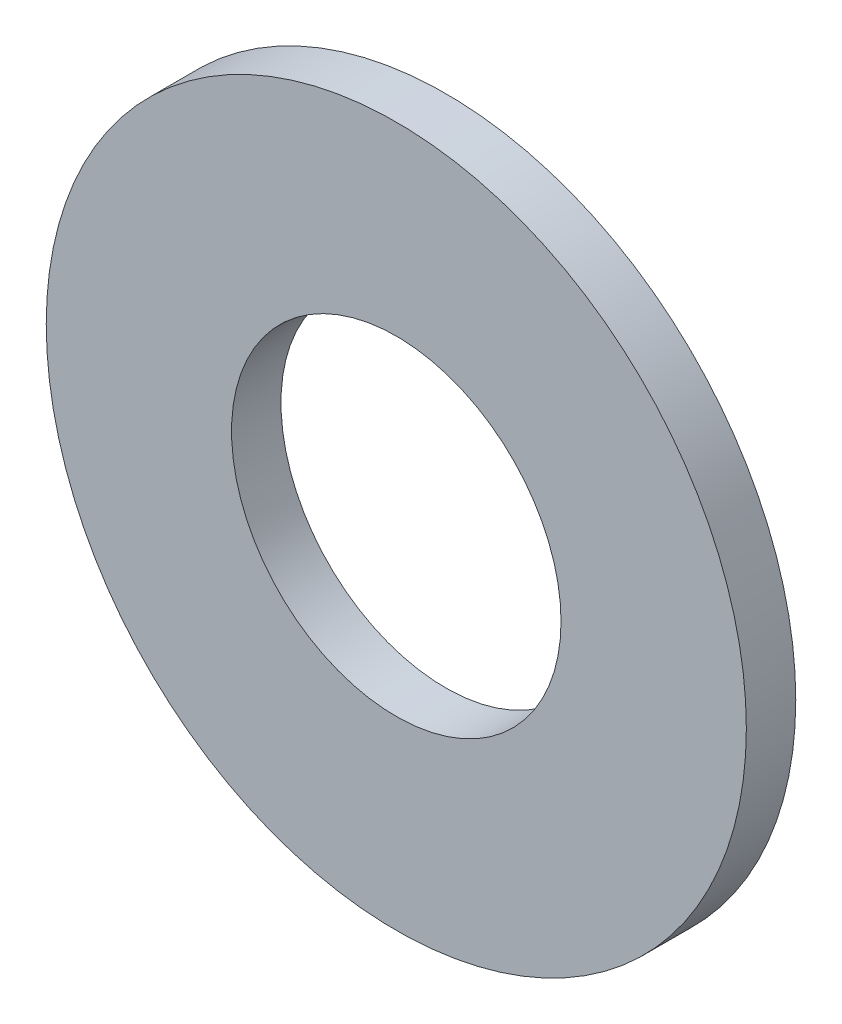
ISO-10303-21;
HEADER;
FILE_DESCRIPTION(('STEP AP214'),'2;1');
FILE_NAME('part.step','',(''),(''),'','','');
FILE_SCHEMA(('AUTOMOTIVE_DESIGN { 1 0 10303 214 1 1 1 1 }'));
ENDSEC;
DATA;
#1=APPLICATION_CONTEXT('core data for automotive mechanical design processes');
#2=APPLICATION_PROTOCOL_DEFINITION('international standard','automotive_design',2000,#1);
#3=PRODUCT_CONTEXT('',#1,'mechanical');
#4=PRODUCT('Part','Part','',(#3));
#5=PRODUCT_RELATED_PRODUCT_CATEGORY('part','',(#4));
#6=PRODUCT_DEFINITION_FORMATION('','',#4);
#7=PRODUCT_DEFINITION_CONTEXT('part definition',#1,'design');
#8=PRODUCT_DEFINITION('design','',#6,#7);
#9=PRODUCT_DEFINITION_SHAPE('','',#8);
#10=(LENGTH_UNIT() NAMED_UNIT(*) SI_UNIT(.MILLI.,.METRE.));
#11=(NAMED_UNIT(*) PLANE_ANGLE_UNIT() SI_UNIT($,.RADIAN.));
#12=(NAMED_UNIT(*) SI_UNIT($,.STERADIAN.) SOLID_ANGLE_UNIT());
#13=UNCERTAINTY_MEASURE_WITH_UNIT(LENGTH_MEASURE(1.E-05),#10,'distance_accuracy_value','');
#14=(GEOMETRIC_REPRESENTATION_CONTEXT(3) GLOBAL_UNCERTAINTY_ASSIGNED_CONTEXT((#13)) GLOBAL_UNIT_ASSIGNED_CONTEXT((#10,
#11,#12)) REPRESENTATION_CONTEXT('',''));
#15=CARTESIAN_POINT('',(0.,0.,0.));
#16=DIRECTION('',(0.,0.,1.));
#17=DIRECTION('',(1.,0.,0.));
#18=AXIS2_PLACEMENT_3D('',#15,#16,#17);
#19=CARTESIAN_POINT('',(0.,0.,1.2));
#20=DIRECTION('',(0.,0.,1.));
#21=DIRECTION('',(1.,0.,0.));
#22=AXIS2_PLACEMENT_3D('',#19,#20,#21);
#23=PLANE('',#22);
#24=CARTESIAN_POINT('',(0.,0.,1.2));
#25=DIRECTION('',(0.,0.,1.));
#26=DIRECTION('',(1.,0.,0.));
#27=AXIS2_PLACEMENT_3D('',#24,#25,#26);
#28=CIRCLE('',#27,8.5);
#29=CARTESIAN_POINT('',(8.5,0.,1.2));
#30=VERTEX_POINT('',#29);
#31=EDGE_CURVE('E10',#30,#30,#28,.T.);
#32=ORIENTED_EDGE('',*,*,#31,.T.);
#33=EDGE_LOOP('',(#32));
#34=FACE_BOUND('',#33,.T.);
#35=CARTESIAN_POINT('',(0.,0.,1.2));
#36=DIRECTION('',(0.,0.,1.));
#37=DIRECTION('',(1.,0.,0.));
#38=AXIS2_PLACEMENT_3D('',#35,#36,#37);
#39=CIRCLE('',#38,4.);
#40=CARTESIAN_POINT('',(4.,0.,1.2));
#41=VERTEX_POINT('',#40);
#42=EDGE_CURVE('E42',#41,#41,#39,.T.);
#43=ORIENTED_EDGE('',*,*,#42,.F.);
#44=EDGE_LOOP('',(#43));
#45=FACE_BOUND('',#44,.T.);
#46=ADVANCED_FACE('F31',(#34,#45),#23,.T.);
#47=CARTESIAN_POINT('',(0.,0.,0.));
#48=DIRECTION('',(0.,0.,1.));
#49=DIRECTION('',(1.,0.,0.));
#50=AXIS2_PLACEMENT_3D('',#47,#48,#49);
#51=PLANE('',#50);
#52=CARTESIAN_POINT('',(0.,0.,0.));
#53=DIRECTION('',(0.,0.,1.));
#54=DIRECTION('',(1.,0.,0.));
#55=AXIS2_PLACEMENT_3D('',#52,#53,#54);
#56=CIRCLE('',#55,8.5);
#57=CARTESIAN_POINT('',(8.5,0.,0.));
#58=VERTEX_POINT('',#57);
#59=EDGE_CURVE('E35',#58,#58,#56,.T.);
#60=ORIENTED_EDGE('',*,*,#59,.F.);
#61=EDGE_LOOP('',(#60));
#62=FACE_BOUND('',#61,.T.);
#63=CARTESIAN_POINT('',(0.,0.,0.));
#64=DIRECTION('',(0.,0.,1.));
#65=DIRECTION('',(1.,0.,0.));
#66=AXIS2_PLACEMENT_3D('',#63,#64,#65);
#67=CIRCLE('',#66,4.);
#68=CARTESIAN_POINT('',(4.,0.,0.));
#69=VERTEX_POINT('',#68);
#70=EDGE_CURVE('E44',#69,#69,#67,.T.);
#71=ORIENTED_EDGE('',*,*,#70,.T.);
#72=EDGE_LOOP('',(#71));
#73=FACE_BOUND('',#72,.T.);
#74=ADVANCED_FACE('F54',(#62,#73),#51,.F.);
#75=CARTESIAN_POINT('',(0.,0.,1.2));
#76=DIRECTION('',(0.,0.,-1.));
#77=DIRECTION('',(-1.,0.,0.));
#78=AXIS2_PLACEMENT_3D('',#75,#76,#77);
#79=CYLINDRICAL_SURFACE('',#78,8.5);
#80=ORIENTED_EDGE('',*,*,#31,.F.);
#81=EDGE_LOOP('',(#80));
#82=FACE_BOUND('',#81,.T.);
#83=ORIENTED_EDGE('',*,*,#59,.T.);
#84=EDGE_LOOP('',(#83));
#85=FACE_BOUND('',#84,.T.);
#86=ADVANCED_FACE('F33',(#82,#85),#79,.T.);
#87=CARTESIAN_POINT('',(0.,0.,1.2));
#88=DIRECTION('',(0.,0.,-1.));
#89=DIRECTION('',(-1.,0.,0.));
#90=AXIS2_PLACEMENT_3D('',#87,#88,#89);
#91=CYLINDRICAL_SURFACE('',#90,4.);
#92=ORIENTED_EDGE('',*,*,#42,.T.);
#93=EDGE_LOOP('',(#92));
#94=FACE_BOUND('',#93,.T.);
#95=ORIENTED_EDGE('',*,*,#70,.F.);
#96=EDGE_LOOP('',(#95));
#97=FACE_BOUND('',#96,.T.);
#98=ADVANCED_FACE('F50',(#94,#97),#91,.F.);
#99=CLOSED_SHELL('',(#46,#74,#86,#98));
#100=MANIFOLD_SOLID_BREP('B2',#99);
#101=ADVANCED_BREP_SHAPE_REPRESENTATION('',(#18,#100),#14);
#102=SHAPE_DEFINITION_REPRESENTATION(#9,#101);
ENDSEC;
END-ISO-10303-21;
